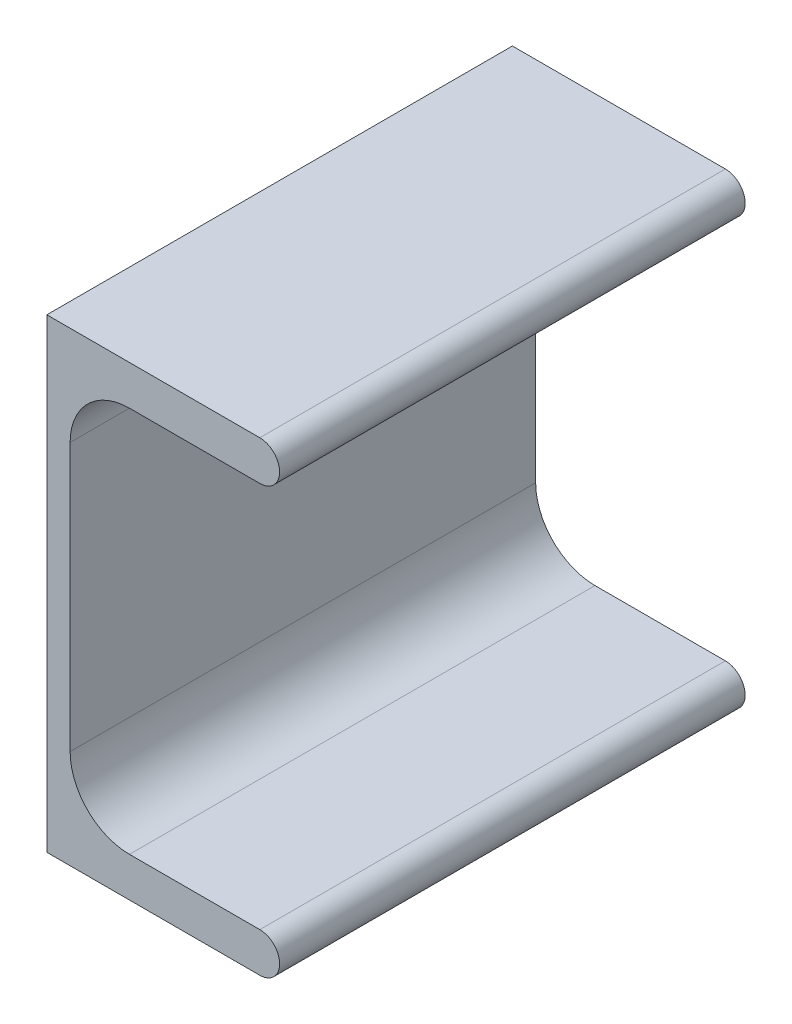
from build123d import *

# Parameters (mm, degrees)
EXTRUDE1_DEPTH = 50


with BuildPart() as part:
    # Sketch1 → Extrude1 (new, symmetric)
    with BuildSketch(Plane.XY):
        with BuildLine():
            Line((45.75, 50), (0, 50))
            Line((0, 50), (0, -50))
            Line((0, -50), (45.75, -50))
            ThreePointArc((45.75, -50), (50, -45.75), (45.75, -41.5))
            Line((45.75, -41.5), (17.75, -41.5))
            ThreePointArc((17.75, -41.5), (8.73438854, -37.76561146), (5, -28.75))
            Line((5, -28.75), (5, 28.75))
            ThreePointArc((5, 28.75), (8.73438854, 37.76561146), (17.75, 41.5))
            Line((17.75, 41.5), (45.75, 41.5))
            ThreePointArc((45.75, 41.5), (50, 45.75), (45.75, 50))
        make_face()
    extrude(amount=EXTRUDE1_DEPTH, both=True)


solid = part.part
